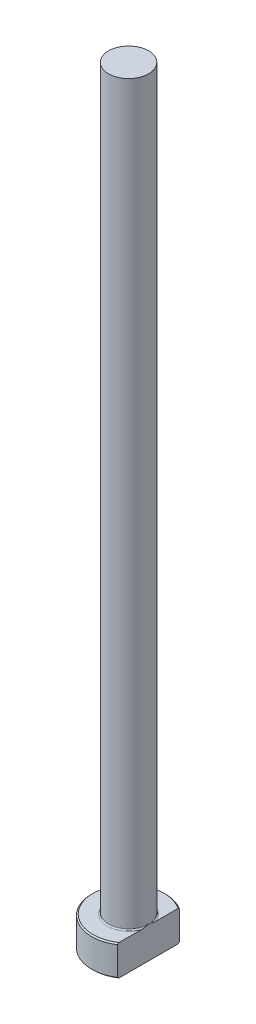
ISO-10303-21;
HEADER;
FILE_DESCRIPTION(('STEP AP214'),'2;1');
FILE_NAME('part.step','',(''),(''),'','','');
FILE_SCHEMA(('AUTOMOTIVE_DESIGN { 1 0 10303 214 1 1 1 1 }'));
ENDSEC;
DATA;
#1=APPLICATION_CONTEXT('core data for automotive mechanical design processes');
#2=APPLICATION_PROTOCOL_DEFINITION('international standard','automotive_design',2000,#1);
#3=PRODUCT_CONTEXT('',#1,'mechanical');
#4=PRODUCT('Part','Part','',(#3));
#5=PRODUCT_RELATED_PRODUCT_CATEGORY('part','',(#4));
#6=PRODUCT_DEFINITION_FORMATION('','',#4);
#7=PRODUCT_DEFINITION_CONTEXT('part definition',#1,'design');
#8=PRODUCT_DEFINITION('design','',#6,#7);
#9=PRODUCT_DEFINITION_SHAPE('','',#8);
#10=(LENGTH_UNIT() NAMED_UNIT(*) SI_UNIT(.MILLI.,.METRE.));
#11=(NAMED_UNIT(*) PLANE_ANGLE_UNIT() SI_UNIT($,.RADIAN.));
#12=(NAMED_UNIT(*) SI_UNIT($,.STERADIAN.) SOLID_ANGLE_UNIT());
#13=UNCERTAINTY_MEASURE_WITH_UNIT(LENGTH_MEASURE(1.E-05),#10,'distance_accuracy_value','');
#14=(GEOMETRIC_REPRESENTATION_CONTEXT(3) GLOBAL_UNCERTAINTY_ASSIGNED_CONTEXT((#13)) GLOBAL_UNIT_ASSIGNED_CONTEXT((#10,
#11,#12)) REPRESENTATION_CONTEXT('',''));
#15=CARTESIAN_POINT('',(0.,0.,0.));
#16=DIRECTION('',(0.,0.,1.));
#17=DIRECTION('',(1.,0.,0.));
#18=AXIS2_PLACEMENT_3D('',#15,#16,#17);
#19=CARTESIAN_POINT('',(0.,0.,0.));
#20=DIRECTION('',(0.,-1.,0.));
#21=DIRECTION('',(0.,0.,-1.));
#22=AXIS2_PLACEMENT_3D('',#19,#20,#21);
#23=PLANE('',#22);
#24=CARTESIAN_POINT('',(0.,0.,0.));
#25=DIRECTION('',(0.,-1.,0.));
#26=DIRECTION('',(0.,0.,-1.));
#27=AXIS2_PLACEMENT_3D('',#24,#25,#26);
#28=CIRCLE('',#27,5.79999999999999);
#29=CARTESIAN_POINT('',(3.24999999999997,0.,4.803904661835));
#30=VERTEX_POINT('',#29);
#31=CARTESIAN_POINT('',(3.24999999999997,0.,-4.803904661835));
#32=VERTEX_POINT('',#31);
#33=EDGE_CURVE('E98',#30,#32,#28,.T.);
#34=ORIENTED_EDGE('',*,*,#33,.T.);
#35=DIRECTION('',(0.,0.,1.));
#36=VECTOR('',#35,1.);
#37=CARTESIAN_POINT('',(3.24999999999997,0.,-5.04356025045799));
#38=LINE('',#37,#36);
#39=EDGE_CURVE('E83',#32,#30,#38,.T.);
#40=ORIENTED_EDGE('',*,*,#39,.T.);
#41=EDGE_LOOP('',(#34,#40));
#42=FACE_BOUND('',#41,.T.);
#43=ADVANCED_FACE('F32',(#42),#23,.T.);
#44=CARTESIAN_POINT('',(0.,259.958771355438,0.));
#45=DIRECTION('',(0.,1.,0.));
#46=DIRECTION('',(0.,0.,1.));
#47=AXIS2_PLACEMENT_3D('',#44,#45,#46);
#48=CYLINDRICAL_SURFACE('',#47,5.99999999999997);
#49=CARTESIAN_POINT('',(0.,4.79999999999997,0.));
#50=DIRECTION('',(0.,1.,0.));
#51=DIRECTION('',(0.,0.,1.));
#52=AXIS2_PLACEMENT_3D('',#49,#50,#51);
#53=CIRCLE('',#52,5.99999999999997);
#54=CARTESIAN_POINT('',(3.24999999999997,4.79999999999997,5.04356025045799));
#55=VERTEX_POINT('',#54);
#56=CARTESIAN_POINT('',(3.24999999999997,4.79999999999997,-5.04356025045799));
#57=VERTEX_POINT('',#56);
#58=EDGE_CURVE('E104',#55,#57,#53,.F.);
#59=ORIENTED_EDGE('',*,*,#58,.T.);
#60=DIRECTION('',(0.,-1.,0.));
#61=VECTOR('',#60,1.);
#62=CARTESIAN_POINT('',(3.24999999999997,125.,-5.04356025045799));
#63=LINE('',#62,#61);
#64=CARTESIAN_POINT('',(3.24999999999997,0.199999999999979,-5.04356025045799));
#65=VERTEX_POINT('',#64);
#66=EDGE_CURVE('E183',#57,#65,#63,.T.);
#67=ORIENTED_EDGE('',*,*,#66,.T.);
#68=CARTESIAN_POINT('',(0.,0.199999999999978,0.));
#69=DIRECTION('',(0.,-1.,0.));
#70=DIRECTION('',(0.,0.,-1.));
#71=AXIS2_PLACEMENT_3D('',#68,#69,#70);
#72=CIRCLE('',#71,5.99999999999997);
#73=CARTESIAN_POINT('',(3.24999999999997,0.199999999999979,5.04356025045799));
#74=VERTEX_POINT('',#73);
#75=EDGE_CURVE('E100',#65,#74,#72,.F.);
#76=ORIENTED_EDGE('',*,*,#75,.T.);
#77=DIRECTION('',(0.,-1.,0.));
#78=VECTOR('',#77,1.);
#79=CARTESIAN_POINT('',(3.24999999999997,125.,5.04356025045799));
#80=LINE('',#79,#78);
#81=EDGE_CURVE('E93',#55,#74,#80,.T.);
#82=ORIENTED_EDGE('',*,*,#81,.F.);
#83=EDGE_LOOP('',(#59,#67,#76,#82));
#84=FACE_BOUND('',#83,.T.);
#85=ADVANCED_FACE('F158',(#84),#48,.T.);
#86=CARTESIAN_POINT('',(-5.99999999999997,5.,0.));
#87=DIRECTION('',(0.,1.,0.));
#88=DIRECTION('',(0.,0.,1.));
#89=AXIS2_PLACEMENT_3D('',#86,#87,#88);
#90=PLANE('',#89);
#91=CARTESIAN_POINT('',(0.,5.,0.));
#92=DIRECTION('',(0.,1.,0.));
#93=DIRECTION('',(0.,0.,1.));
#94=AXIS2_PLACEMENT_3D('',#91,#92,#93);
#95=CIRCLE('',#94,5.79999999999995);
#96=CARTESIAN_POINT('',(3.24999999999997,5.,-4.80390466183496));
#97=VERTEX_POINT('',#96);
#98=CARTESIAN_POINT('',(3.24999999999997,5.,4.80390466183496));
#99=VERTEX_POINT('',#98);
#100=EDGE_CURVE('E178',#97,#99,#95,.T.);
#101=ORIENTED_EDGE('',*,*,#100,.T.);
#102=DIRECTION('',(0.,0.,-1.));
#103=VECTOR('',#102,1.);
#104=CARTESIAN_POINT('',(3.24999999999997,5.,0.));
#105=LINE('',#104,#103);
#106=CARTESIAN_POINT('',(3.24999999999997,4.99999999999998,1.15758369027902));
#107=VERTEX_POINT('',#106);
#108=EDGE_CURVE('E57',#99,#107,#105,.T.);
#109=ORIENTED_EDGE('',*,*,#108,.T.);
#110=CARTESIAN_POINT('',(0.,5.,0.));
#111=DIRECTION('',(0.,1.,0.));
#112=DIRECTION('',(0.,0.,1.));
#113=AXIS2_PLACEMENT_3D('',#110,#111,#112);
#114=CIRCLE('',#113,3.44999999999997);
#115=CARTESIAN_POINT('',(3.24999999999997,4.99999999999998,-1.15758369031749));
#116=VERTEX_POINT('',#115);
#117=EDGE_CURVE('E107',#107,#116,#114,.F.);
#118=ORIENTED_EDGE('',*,*,#117,.T.);
#119=EDGE_CURVE('E136',#116,#97,#105,.T.);
#120=ORIENTED_EDGE('',*,*,#119,.T.);
#121=EDGE_LOOP('',(#101,#109,#118,#120));
#122=FACE_BOUND('',#121,.T.);
#123=ADVANCED_FACE('F147',(#122),#90,.T.);
#124=CARTESIAN_POINT('',(0.,5.,0.));
#125=DIRECTION('',(0.,-1.,0.));
#126=DIRECTION('',(0.,0.,-1.));
#127=AXIS2_PLACEMENT_3D('',#124,#125,#126);
#128=CONICAL_SURFACE('',#127,5.79999999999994,0.785398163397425);
#129=ORIENTED_EDGE('',*,*,#58,.F.);
#130=CARTESIAN_POINT('',(3.24999999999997,-0.763340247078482,11.0972220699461));
#131=CARTESIAN_POINT('',(3.24999999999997,-0.555249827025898,10.8803821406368));
#132=CARTESIAN_POINT('',(3.24999999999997,-0.347401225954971,10.6633095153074));
#133=CARTESIAN_POINT('',(3.24999999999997,0.0676973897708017,10.2285893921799));
#134=CARTESIAN_POINT('',(3.24999999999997,0.274947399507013,10.0109418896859));
#135=CARTESIAN_POINT('',(3.24999999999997,0.688790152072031,9.57490319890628));
#136=CARTESIAN_POINT('',(3.24999999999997,0.895382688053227,9.35651181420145));
#137=CARTESIAN_POINT('',(3.24999999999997,1.30769007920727,8.91890298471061));
#138=CARTESIAN_POINT('',(3.24999999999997,1.51340493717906,8.69968554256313));
#139=CARTESIAN_POINT('',(3.24999999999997,1.92056067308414,8.26365159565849));
#140=CARTESIAN_POINT('',(3.24999999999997,2.12201828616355,8.04685072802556));
#141=CARTESIAN_POINT('',(3.24999999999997,2.52361432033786,7.61203089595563));
#142=CARTESIAN_POINT('',(3.24999999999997,2.72375274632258,7.39401193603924));
#143=CARTESIAN_POINT('',(3.24999999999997,3.12232031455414,6.95646589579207));
#144=CARTESIAN_POINT('',(3.24999999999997,3.3207496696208,6.73693900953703));
#145=CARTESIAN_POINT('',(3.24999999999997,3.71541049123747,6.29592064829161));
#146=CARTESIAN_POINT('',(3.24999999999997,3.91164199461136,6.07442920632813));
#147=CARTESIAN_POINT('',(3.24999999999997,4.26795525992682,5.6668464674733));
#148=CARTESIAN_POINT('',(3.24999999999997,4.42849662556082,5.48115751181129));
#149=CARTESIAN_POINT('',(3.24999999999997,4.74694681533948,5.10749706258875));
#150=CARTESIAN_POINT('',(3.24999999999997,4.90485537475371,4.91952534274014));
#151=CARTESIAN_POINT('',(3.24999999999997,5.21865243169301,4.53879767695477));
#152=CARTESIAN_POINT('',(3.24999999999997,5.37450606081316,4.34601291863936));
#153=CARTESIAN_POINT('',(3.24999999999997,5.68118935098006,3.95653844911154));
#154=CARTESIAN_POINT('',(3.24999999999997,5.83202036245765,3.75984981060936));
#155=CARTESIAN_POINT('',(3.24999999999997,6.05390638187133,3.45940852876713));
#156=CARTESIAN_POINT('',(3.24999999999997,6.12763821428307,3.35763377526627));
#157=CARTESIAN_POINT('',(3.24999999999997,6.27282302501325,3.1524747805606));
#158=CARTESIAN_POINT('',(3.24999999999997,6.34427612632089,3.04909062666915));
#159=CARTESIAN_POINT('',(3.24999999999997,6.48448981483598,2.84026816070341));
#160=CARTESIAN_POINT('',(3.24999999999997,6.55324599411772,2.73482687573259));
#161=CARTESIAN_POINT('',(3.24999999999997,6.68723865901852,2.52174014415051));
#162=CARTESIAN_POINT('',(3.24999999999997,6.75247550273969,2.41409492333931));
#163=CARTESIAN_POINT('',(3.24999999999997,6.87780644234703,2.19745654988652));
#164=CARTESIAN_POINT('',(3.24999999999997,6.93795082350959,2.08849289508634));
#165=CARTESIAN_POINT('',(3.24999999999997,7.05273719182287,1.86772106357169));
#166=CARTESIAN_POINT('',(3.24999999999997,7.10737807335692,1.75591232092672));
#167=CARTESIAN_POINT('',(3.24999999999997,7.26056715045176,1.41626442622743));
#168=CARTESIAN_POINT('',(3.24999999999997,7.34888232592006,1.18338115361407));
#169=CARTESIAN_POINT('',(3.24999999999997,7.44593218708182,0.835575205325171));
#170=CARTESIAN_POINT('',(3.24999999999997,7.47182229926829,0.725406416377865));
#171=CARTESIAN_POINT('',(3.24999999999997,7.51310579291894,0.503078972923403));
#172=CARTESIAN_POINT('',(3.24999999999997,7.52850034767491,0.390920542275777));
#173=CARTESIAN_POINT('',(3.24999999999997,7.54767882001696,0.166070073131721));
#174=CARTESIAN_POINT('',(3.24999999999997,7.5515109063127,0.0533822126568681));
#175=CARTESIAN_POINT('',(3.24999999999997,7.54741082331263,-0.171782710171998));
#176=CARTESIAN_POINT('',(3.24999999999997,7.53947794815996,-0.28425975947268));
#177=CARTESIAN_POINT('',(3.24999999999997,7.5125352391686,-0.50702510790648));
#178=CARTESIAN_POINT('',(3.24999999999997,7.4936058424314,-0.617323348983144));
#179=CARTESIAN_POINT('',(3.24999999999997,7.44595440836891,-0.835762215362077));
#180=CARTESIAN_POINT('',(3.24999999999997,7.41723093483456,-0.94390252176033));
#181=CARTESIAN_POINT('',(3.24999999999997,7.35127840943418,-1.15830231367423));
#182=CARTESIAN_POINT('',(3.24999999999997,7.31399439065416,-1.2645446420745));
#183=CARTESIAN_POINT('',(3.24999999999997,7.23254630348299,-1.4743033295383));
#184=CARTESIAN_POINT('',(3.24999999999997,7.18838353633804,-1.57782019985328));
#185=CARTESIAN_POINT('',(3.24999999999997,7.09672451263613,-1.77742382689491));
#186=CARTESIAN_POINT('',(3.24999999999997,7.04948595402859,-1.87363004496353));
#187=CARTESIAN_POINT('',(3.24999999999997,6.95089019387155,-2.0639177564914));
#188=CARTESIAN_POINT('',(3.24999999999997,6.8995321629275,-2.15799881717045));
#189=CARTESIAN_POINT('',(3.24999999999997,6.74036914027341,-2.43755985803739));
#190=CARTESIAN_POINT('',(3.24999999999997,6.62755752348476,-2.62018561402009));
#191=CARTESIAN_POINT('',(3.24999999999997,6.39256809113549,-2.98019331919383));
#192=CARTESIAN_POINT('',(3.24999999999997,6.27035601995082,-3.15755247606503));
#193=CARTESIAN_POINT('',(3.24999999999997,6.01970117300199,-3.50765833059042));
#194=CARTESIAN_POINT('',(3.24999999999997,5.89126140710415,-3.68040719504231));
#195=CARTESIAN_POINT('',(3.24999999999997,5.62829316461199,-4.02448614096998));
#196=CARTESIAN_POINT('',(3.24999999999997,5.4937100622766,-4.19577421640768));
#197=CARTESIAN_POINT('',(3.24999999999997,5.22110967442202,-4.53561452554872));
#198=CARTESIAN_POINT('',(3.24999999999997,5.08309204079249,-4.70416647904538));
#199=CARTESIAN_POINT('',(3.24999999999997,4.80478673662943,-5.03871726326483));
#200=CARTESIAN_POINT('',(3.24999999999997,4.66450509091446,-5.20472111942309));
#201=CARTESIAN_POINT('',(3.24999999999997,4.38193422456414,-5.53501285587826));
#202=CARTESIAN_POINT('',(3.24999999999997,4.23964496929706,-5.6993007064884));
#203=CARTESIAN_POINT('',(3.24999999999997,3.89726045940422,-6.09077577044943));
#204=CARTESIAN_POINT('',(3.24999999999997,3.69642117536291,-6.31731165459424));
#205=CARTESIAN_POINT('',(3.24999999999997,3.29246897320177,-6.76834962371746));
#206=CARTESIAN_POINT('',(3.24999999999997,3.08935601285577,-6.99285167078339));
#207=CARTESIAN_POINT('',(3.24999999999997,2.68122553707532,-7.44046009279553));
#208=CARTESIAN_POINT('',(3.24999999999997,2.4762065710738,-7.66356514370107));
#209=CARTESIAN_POINT('',(3.24999999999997,2.06481442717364,-8.10852300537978));
#210=CARTESIAN_POINT('',(3.24999999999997,1.85844124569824,-8.33037581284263));
#211=CARTESIAN_POINT('',(3.24999999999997,1.45176082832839,-8.76543407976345));
#212=CARTESIAN_POINT('',(3.24999999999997,1.25149010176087,-8.97867369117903));
#213=CARTESIAN_POINT('',(3.24999999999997,0.850131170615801,-9.40438299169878));
#214=CARTESIAN_POINT('',(3.24999999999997,0.649042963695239,-9.61685267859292));
#215=CARTESIAN_POINT('',(3.24999999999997,0.246391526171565,-10.0409455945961));
#216=CARTESIAN_POINT('',(3.24999999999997,0.0448289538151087,-10.252569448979));
#217=CARTESIAN_POINT('',(3.24999999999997,-0.358859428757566,-10.6752763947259));
#218=CARTESIAN_POINT('',(3.24999999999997,-0.560985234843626,-10.8863594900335));
#219=CARTESIAN_POINT('',(3.24999999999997,-0.763340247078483,-11.0972220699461));
#220=B_SPLINE_CURVE_WITH_KNOTS('',3,(#130,#131,#132,#133,#134,#135,#136,#137,#138,#139,#140,
#141,#142,#143,#144,#145,#146,#147,#148,#149,#150,#151,#152,#153,#154,#155,#156,#157,#158,#159,
#160,#161,#162,#163,#164,#165,#166,#167,#168,#169,#170,#171,#172,#173,#174,#175,#176,#177,#178,
#179,#180,#181,#182,#183,#184,#185,#186,#187,#188,#189,#190,#191,#192,#193,#194,#195,#196,#197,
#198,#199,#200,#201,#202,#203,#204,#205,#206,#207,#208,#209,#210,#211,#212,#213,#214,#215,#216,
#217,#218,#219),.UNSPECIFIED.,.F.,.F.,(4,2,2,2,2,2,2,2,2,2,2,2,2,2,2,2,2,2,2,2,2,2,2,2,2,2,2,2,
2,2,2,2,2,2,2,2,2,2,2,2,2,2,2,2,4),(0.,0.901604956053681,1.80321729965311,2.70508973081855,
3.60695928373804,4.49481204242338,5.38266150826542,6.27039876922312,7.15812113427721,
7.89450333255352,8.63095913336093,9.37461869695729,10.1180766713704,10.4950808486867,
10.8720646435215,11.2496408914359,11.6271786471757,12.0003984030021,12.3736929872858,
13.1174054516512,13.45650589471,13.7955684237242,14.1332164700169,14.4708847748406,
14.8061136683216,15.141391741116,15.478886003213,15.8163164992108,16.1377318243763,
16.4592120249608,17.1027431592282,17.7487418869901,18.3944314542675,19.0478814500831,
19.7013979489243,20.353394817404,21.0054029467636,21.9136176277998,22.821849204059,
23.7308402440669,24.6398336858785,25.5174503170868,26.3950694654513,27.2718289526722,
28.1485820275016),.UNSPECIFIED.);
#221=EDGE_CURVE('E135',#55,#99,#220,.T.);
#222=ORIENTED_EDGE('',*,*,#221,.T.);
#223=ORIENTED_EDGE('',*,*,#100,.F.);
#224=EDGE_CURVE('E127',#97,#57,#220,.T.);
#225=ORIENTED_EDGE('',*,*,#224,.T.);
#226=EDGE_LOOP('',(#129,#222,#223,#225));
#227=FACE_BOUND('',#226,.T.);
#228=ADVANCED_FACE('F143',(#227),#128,.T.);
#229=CARTESIAN_POINT('',(0.,0.199999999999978,0.));
#230=DIRECTION('',(0.,1.,0.));
#231=DIRECTION('',(0.,0.,1.));
#232=AXIS2_PLACEMENT_3D('',#229,#230,#231);
#233=CONICAL_SURFACE('',#232,5.99999999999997,0.785398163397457);
#234=ORIENTED_EDGE('',*,*,#75,.F.);
#235=CARTESIAN_POINT('',(3.24999999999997,5.76334024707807,-11.097222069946));
#236=CARTESIAN_POINT('',(3.24999999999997,5.5552498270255,-10.8803821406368));
#237=CARTESIAN_POINT('',(3.24999999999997,5.34740122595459,-10.6633095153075));
#238=CARTESIAN_POINT('',(3.24999999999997,4.93230261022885,-10.2285893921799));
#239=CARTESIAN_POINT('',(3.24999999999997,4.72505260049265,-10.0109418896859));
#240=CARTESIAN_POINT('',(3.24999999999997,4.31120984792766,-9.57490319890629));
#241=CARTESIAN_POINT('',(3.24999999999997,4.10461731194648,-9.35651181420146));
#242=CARTESIAN_POINT('',(3.24999999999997,3.69230992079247,-8.91890298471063));
#243=CARTESIAN_POINT('',(3.24999999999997,3.4865950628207,-8.69968554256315));
#244=CARTESIAN_POINT('',(3.24999999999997,3.07943932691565,-8.26365159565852));
#245=CARTESIAN_POINT('',(3.24999999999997,2.87798171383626,-8.0468507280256));
#246=CARTESIAN_POINT('',(3.24999999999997,2.47638567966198,-7.61203089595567));
#247=CARTESIAN_POINT('',(3.24999999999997,2.27624725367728,-7.3940119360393));
#248=CARTESIAN_POINT('',(3.24999999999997,1.87767968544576,-6.95646589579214));
#249=CARTESIAN_POINT('',(3.24999999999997,1.67925033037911,-6.7369390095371));
#250=CARTESIAN_POINT('',(3.24999999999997,1.28458950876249,-6.2959206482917));
#251=CARTESIAN_POINT('',(3.24999999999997,1.08835800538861,-6.07442920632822));
#252=CARTESIAN_POINT('',(3.24999999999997,0.732044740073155,-5.66684646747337));
#253=CARTESIAN_POINT('',(3.24999999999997,0.571503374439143,-5.48115751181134));
#254=CARTESIAN_POINT('',(3.24999999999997,0.253053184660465,-5.10749706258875));
#255=CARTESIAN_POINT('',(3.24999999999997,0.0951446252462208,-4.91952534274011));
#256=CARTESIAN_POINT('',(3.24999999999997,-0.218652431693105,-4.53879767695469));
#257=CARTESIAN_POINT('',(3.24999999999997,-0.374506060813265,-4.34601291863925));
#258=CARTESIAN_POINT('',(3.24999999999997,-0.681189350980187,-3.95653844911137));
#259=CARTESIAN_POINT('',(3.24999999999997,-0.832020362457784,-3.75984981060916));
#260=CARTESIAN_POINT('',(3.24999999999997,-1.05390638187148,-3.45940852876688));
#261=CARTESIAN_POINT('',(3.24999999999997,-1.12763821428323,-3.35763377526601));
#262=CARTESIAN_POINT('',(3.24999999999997,-1.27282302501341,-3.1524747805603));
#263=CARTESIAN_POINT('',(3.24999999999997,-1.34427612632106,-3.04909062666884));
#264=CARTESIAN_POINT('',(3.24999999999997,-1.48448981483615,-2.84026816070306));
#265=CARTESIAN_POINT('',(3.24999999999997,-1.55324599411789,-2.73482687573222));
#266=CARTESIAN_POINT('',(3.24999999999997,-1.68723865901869,-2.52174014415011));
#267=CARTESIAN_POINT('',(3.24999999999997,-1.75247550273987,-2.41409492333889));
#268=CARTESIAN_POINT('',(3.24999999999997,-1.8778064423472,-2.19745654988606));
#269=CARTESIAN_POINT('',(3.24999999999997,-1.93795082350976,-2.08849289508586));
#270=CARTESIAN_POINT('',(3.24999999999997,-2.05273719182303,-1.86772106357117));
#271=CARTESIAN_POINT('',(3.24999999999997,-2.10737807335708,-1.75591232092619));
#272=CARTESIAN_POINT('',(3.24999999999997,-2.26056715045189,-1.41626442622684));
#273=CARTESIAN_POINT('',(3.24999999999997,-2.34888232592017,-1.18338115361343));
#274=CARTESIAN_POINT('',(3.24999999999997,-2.44593218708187,-0.83557520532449));
#275=CARTESIAN_POINT('',(3.24999999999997,-2.47182229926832,-0.725406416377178));
#276=CARTESIAN_POINT('',(3.24999999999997,-2.51310579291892,-0.503078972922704));
#277=CARTESIAN_POINT('',(3.24999999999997,-2.52850034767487,-0.390920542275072));
#278=CARTESIAN_POINT('',(3.24999999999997,-2.54767882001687,-0.166070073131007));
#279=CARTESIAN_POINT('',(3.24999999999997,-2.55151090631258,-0.0533822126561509));
#280=CARTESIAN_POINT('',(3.24999999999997,-2.54741082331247,0.171782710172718));
#281=CARTESIAN_POINT('',(3.24999999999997,-2.53947794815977,0.284259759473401));
#282=CARTESIAN_POINT('',(3.24999999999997,-2.51253523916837,0.507025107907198));
#283=CARTESIAN_POINT('',(3.24999999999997,-2.49360584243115,0.617323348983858));
#284=CARTESIAN_POINT('',(3.24999999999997,-2.44595440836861,0.835762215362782));
#285=CARTESIAN_POINT('',(3.24999999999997,-2.41723093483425,0.94390252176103));
#286=CARTESIAN_POINT('',(3.24999999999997,-2.35127840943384,1.15830231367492));
#287=CARTESIAN_POINT('',(3.24999999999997,-2.3139943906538,1.26454464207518));
#288=CARTESIAN_POINT('',(3.24999999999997,-2.23254630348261,1.47430332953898));
#289=CARTESIAN_POINT('',(3.24999999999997,-2.18838353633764,1.57782019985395));
#290=CARTESIAN_POINT('',(3.24999999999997,-2.09672451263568,1.77742382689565));
#291=CARTESIAN_POINT('',(3.24999999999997,-2.04948595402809,1.87363004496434));
#292=CARTESIAN_POINT('',(3.24999999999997,-1.95089019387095,2.06391775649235));
#293=CARTESIAN_POINT('',(3.24999999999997,-1.89953216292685,2.15799881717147));
#294=CARTESIAN_POINT('',(3.24999999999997,-1.7403691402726,2.43755985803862));
#295=CARTESIAN_POINT('',(3.24999999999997,-1.62755752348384,2.62018561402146));
#296=CARTESIAN_POINT('',(3.24999999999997,-1.39256809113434,2.98019331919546));
#297=CARTESIAN_POINT('',(3.24999999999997,-1.27035601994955,3.15755247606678));
#298=CARTESIAN_POINT('',(3.24999999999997,-1.01970117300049,3.50765833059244));
#299=CARTESIAN_POINT('',(3.24999999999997,-0.89126140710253,3.68040719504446));
#300=CARTESIAN_POINT('',(3.24999999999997,-0.628293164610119,4.02448614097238));
#301=CARTESIAN_POINT('',(3.24999999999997,-0.493710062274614,4.19577421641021));
#302=CARTESIAN_POINT('',(3.24999999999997,-0.221109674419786,4.5356145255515));
#303=CARTESIAN_POINT('',(3.24999999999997,-0.0830920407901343,4.70416647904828));
#304=CARTESIAN_POINT('',(3.24999999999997,0.19521326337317,5.03871726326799));
#305=CARTESIAN_POINT('',(3.24999999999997,0.335494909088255,5.20472111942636));
#306=CARTESIAN_POINT('',(3.24999999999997,0.61806577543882,5.53501285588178));
#307=CARTESIAN_POINT('',(3.24999999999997,0.760355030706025,5.69930070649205));
#308=CARTESIAN_POINT('',(3.24999999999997,1.10273954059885,6.09077577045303));
#309=CARTESIAN_POINT('',(3.24999999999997,1.30357882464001,6.31731165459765));
#310=CARTESIAN_POINT('',(3.24999999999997,1.70753102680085,6.76834962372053));
#311=CARTESIAN_POINT('',(3.24999999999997,1.91064398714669,6.99285167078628));
#312=CARTESIAN_POINT('',(3.24999999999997,2.31877446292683,7.44046009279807));
#313=CARTESIAN_POINT('',(3.24999999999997,2.52379342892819,7.66356514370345));
#314=CARTESIAN_POINT('',(3.24999999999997,2.93518557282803,8.10852300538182));
#315=CARTESIAN_POINT('',(3.24999999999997,3.14155875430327,8.33037581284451));
#316=CARTESIAN_POINT('',(3.24999999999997,3.54823917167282,8.76543407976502));
#317=CARTESIAN_POINT('',(3.24999999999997,3.74850989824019,8.97867369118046));
#318=CARTESIAN_POINT('',(3.24999999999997,4.14986882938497,9.40438299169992));
#319=CARTESIAN_POINT('',(3.24999999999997,4.35095703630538,9.61685267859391));
#320=CARTESIAN_POINT('',(3.24999999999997,4.75360847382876,10.0409455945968));
#321=CARTESIAN_POINT('',(3.24999999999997,4.95517104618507,10.2525694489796));
#322=CARTESIAN_POINT('',(3.24999999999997,5.35885942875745,10.6752763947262));
#323=CARTESIAN_POINT('',(3.24999999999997,5.56098523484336,10.8863594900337));
#324=CARTESIAN_POINT('',(3.24999999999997,5.76334024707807,11.097222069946));
#325=B_SPLINE_CURVE_WITH_KNOTS('',3,(#235,#236,#237,#238,#239,#240,#241,#242,#243,#244,#245,
#246,#247,#248,#249,#250,#251,#252,#253,#254,#255,#256,#257,#258,#259,#260,#261,#262,#263,#264,
#265,#266,#267,#268,#269,#270,#271,#272,#273,#274,#275,#276,#277,#278,#279,#280,#281,#282,#283,
#284,#285,#286,#287,#288,#289,#290,#291,#292,#293,#294,#295,#296,#297,#298,#299,#300,#301,#302,
#303,#304,#305,#306,#307,#308,#309,#310,#311,#312,#313,#314,#315,#316,#317,#318,#319,#320,#321,
#322,#323,#324),.UNSPECIFIED.,.F.,.F.,(4,2,2,2,2,2,2,2,2,2,2,2,2,2,2,2,2,2,2,2,2,2,2,2,2,2,2,2,
2,2,2,2,2,2,2,2,2,2,2,2,2,2,2,2,4),(0.,0.901604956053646,1.80321729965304,2.70508973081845,
3.6069592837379,4.49481204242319,5.38266150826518,6.27039876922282,7.15812113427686,
7.89450333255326,8.63095913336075,9.37461869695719,10.1180766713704,10.4950808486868,
10.8720646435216,11.249640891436,11.6271786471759,12.0003984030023,12.3736929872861,
13.1174054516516,13.4565058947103,13.7955684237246,14.1332164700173,14.470884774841,
14.806113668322,15.1413917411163,15.4788860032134,15.8163164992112,16.1377318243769,
16.4592120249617,17.1027431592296,17.7487418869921,18.39443145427,19.0478814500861,
19.7013979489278,20.353394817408,21.0054029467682,21.9136176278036,22.8218492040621,
23.7308402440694,24.6398336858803,25.517450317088,26.3950694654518,27.2718289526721,
28.1485820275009),.UNSPECIFIED.);
#326=EDGE_CURVE('E86',#65,#32,#325,.T.);
#327=ORIENTED_EDGE('',*,*,#326,.T.);
#328=ORIENTED_EDGE('',*,*,#33,.F.);
#329=EDGE_CURVE('E89',#30,#74,#325,.T.);
#330=ORIENTED_EDGE('',*,*,#329,.T.);
#331=EDGE_LOOP('',(#234,#327,#328,#330));
#332=FACE_BOUND('',#331,.T.);
#333=ADVANCED_FACE('F97',(#332),#233,.T.);
#334=CARTESIAN_POINT('',(0.,5.19999999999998,0.));
#335=DIRECTION('',(0.,1.,0.));
#336=DIRECTION('',(0.,0.,1.));
#337=AXIS2_PLACEMENT_3D('',#334,#335,#336);
#338=TOROIDAL_SURFACE('',#337,3.44999999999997,0.2);
#339=CARTESIAN_POINT('',(3.24999999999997,5.19999999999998,0.));
#340=CARTESIAN_POINT('',(3.24999999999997,5.20000050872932,1.30593484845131E-10));
#341=CARTESIAN_POINT('',(3.24999999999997,5.20000101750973,-2.02989018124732E-07));
#342=CARTESIAN_POINT('',(3.24999999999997,5.20000196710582,-7.62846146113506E-07));
#343=CARTESIAN_POINT('',(3.24999999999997,5.20000239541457,-1.13332165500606E-06));
#344=CARTESIAN_POINT('',(3.24999999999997,5.20000328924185,-2.02149564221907E-06));
#345=CARTESIAN_POINT('',(3.24999999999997,5.20000374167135,-2.55359112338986E-06));
#346=CARTESIAN_POINT('',(3.24999999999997,5.20000454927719,-3.65434903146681E-06));
#347=CARTESIAN_POINT('',(3.24999999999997,5.20000490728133,-4.22110424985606E-06));
#348=CARTESIAN_POINT('',(3.24999999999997,5.20000624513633,-6.42540895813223E-06));
#349=CARTESIAN_POINT('',(3.24999999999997,5.20000715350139,-8.1091236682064E-06));
#350=CARTESIAN_POINT('',(3.24999999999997,5.20000863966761,-1.14364149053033E-05));
#351=CARTESIAN_POINT('',(3.24999999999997,5.20000923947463,-1.30705587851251E-05));
#352=CARTESIAN_POINT('',(3.24999999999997,5.20001177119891,-2.00139280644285E-05));
#353=CARTESIAN_POINT('',(3.24999999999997,5.20001367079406,-2.53379428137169E-05));
#354=CARTESIAN_POINT('',(3.24999999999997,5.20001645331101,-3.53765138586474E-05));
#355=CARTESIAN_POINT('',(3.24999999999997,5.20001744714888,-4.00600779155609E-05));
#356=CARTESIAN_POINT('',(3.24999999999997,5.20002471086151,-7.49504389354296E-05));
#357=CARTESIAN_POINT('',(3.24999999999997,5.20003024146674,-0.00010526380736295));
#358=CARTESIAN_POINT('',(3.24999999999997,5.20005445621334,-0.00022532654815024));
#359=CARTESIAN_POINT('',(3.24999999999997,5.20007753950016,-0.000314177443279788));
#360=CARTESIAN_POINT('',(3.24999999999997,5.20016768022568,-0.000666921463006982));
#361=CARTESIAN_POINT('',(3.24999999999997,5.20023191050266,-0.000931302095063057));
#362=CARTESIAN_POINT('',(3.24999999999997,5.20048969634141,-0.00198463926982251));
#363=CARTESIAN_POINT('',(3.24999999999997,5.20068683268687,-0.0027729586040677));
#364=CARTESIAN_POINT('',(3.24999999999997,5.20150726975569,-0.00606245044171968));
#365=CARTESIAN_POINT('',(3.24999999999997,5.20212605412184,-0.00856442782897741));
#366=CARTESIAN_POINT('',(3.24999999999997,5.20719838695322,-0.0290628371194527));
#367=CARTESIAN_POINT('',(3.24999999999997,5.21166800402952,-0.0470565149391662));
#368=CARTESIAN_POINT('',(3.24999999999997,5.22040162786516,-0.0823313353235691));
#369=CARTESIAN_POINT('',(3.24999999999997,5.22466671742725,-0.0996122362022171));
#370=CARTESIAN_POINT('',(3.24999999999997,5.23855308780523,-0.156076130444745));
#371=CARTESIAN_POINT('',(3.24999999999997,5.24811538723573,-0.195273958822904));
#372=CARTESIAN_POINT('',(3.24999999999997,5.26421029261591,-0.262424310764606));
#373=CARTESIAN_POINT('',(3.24999999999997,5.27082096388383,-0.290358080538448));
#374=CARTESIAN_POINT('',(3.24999999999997,5.28365202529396,-0.345539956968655));
#375=CARTESIAN_POINT('',(3.24999999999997,5.28987810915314,-0.3727867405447));
#376=CARTESIAN_POINT('',(3.24999999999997,5.30721519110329,-0.45039737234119));
#377=CARTESIAN_POINT('',(3.24999999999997,5.31800675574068,-0.500833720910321));
#378=CARTESIAN_POINT('',(3.24999999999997,5.33836987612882,-0.60242326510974));
#379=CARTESIAN_POINT('',(3.24999999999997,5.34792968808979,-0.653578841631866));
#380=CARTESIAN_POINT('',(3.24999999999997,5.36597954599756,-0.760718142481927));
#381=CARTESIAN_POINT('',(3.24999999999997,5.37430170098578,-0.81673101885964));
#382=CARTESIAN_POINT('',(3.24999999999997,5.38793579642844,-0.928977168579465));
#383=CARTESIAN_POINT('',(3.24999999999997,5.39325594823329,-0.985209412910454));
#384=CARTESIAN_POINT('',(3.24999999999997,5.39967715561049,-1.09627192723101));
#385=CARTESIAN_POINT('',(3.24999999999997,5.40090002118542,-1.15109363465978));
#386=CARTESIAN_POINT('',(3.24999999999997,5.39854105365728,-1.23278196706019));
#387=CARTESIAN_POINT('',(3.24999999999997,5.397083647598,-1.25970835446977));
#388=CARTESIAN_POINT('',(3.24999999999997,5.39248016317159,-1.31340846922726));
#389=CARTESIAN_POINT('',(3.24999999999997,5.38933527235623,-1.34018229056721));
#390=CARTESIAN_POINT('',(3.24999999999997,5.38085808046,-1.39365539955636));
#391=CARTESIAN_POINT('',(3.24999999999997,5.37550486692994,-1.42035144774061));
#392=CARTESIAN_POINT('',(3.24999999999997,5.36186683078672,-1.47304562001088));
#393=CARTESIAN_POINT('',(3.24999999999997,5.35358306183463,-1.49904399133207));
#394=CARTESIAN_POINT('',(3.24999999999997,5.33840624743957,-1.53566403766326));
#395=CARTESIAN_POINT('',(3.24999999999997,5.33319528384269,-1.54697847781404));
#396=CARTESIAN_POINT('',(3.24999999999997,5.32165705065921,-1.56904809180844));
#397=CARTESIAN_POINT('',(3.24999999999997,5.31532920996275,-1.57980297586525));
#398=CARTESIAN_POINT('',(3.24999999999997,5.30232638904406,-1.5988624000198));
#399=CARTESIAN_POINT('',(3.24999999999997,5.2958406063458,-1.60729427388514));
#400=CARTESIAN_POINT('',(3.24999999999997,5.28165581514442,-1.62307272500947));
#401=CARTESIAN_POINT('',(3.24999999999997,5.2739607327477,-1.63042267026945));
#402=CARTESIAN_POINT('',(3.24999999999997,5.26066720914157,-1.64067803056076));
#403=CARTESIAN_POINT('',(3.24999999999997,5.25551950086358,-1.64416379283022));
#404=CARTESIAN_POINT('',(3.24999999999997,5.24475577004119,-1.65032852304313));
#405=CARTESIAN_POINT('',(3.24999999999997,5.23914006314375,-1.65300802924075));
#406=CARTESIAN_POINT('',(3.24999999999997,5.22744494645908,-1.65736207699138));
#407=CARTESIAN_POINT('',(3.24999999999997,5.22136079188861,-1.65902420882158));
#408=CARTESIAN_POINT('',(3.24999999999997,5.20898349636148,-1.66109219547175));
#409=CARTESIAN_POINT('',(3.24999999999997,5.20269065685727,-1.66149978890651));
#410=CARTESIAN_POINT('',(3.24999999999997,5.19107570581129,-1.66104520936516));
#411=CARTESIAN_POINT('',(3.24999999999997,5.18574582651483,-1.66035949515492));
#412=CARTESIAN_POINT('',(3.24999999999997,5.17527668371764,-1.65810570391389));
#413=CARTESIAN_POINT('',(3.24999999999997,5.1701375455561,-1.65653705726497));
#414=CARTESIAN_POINT('',(3.24999999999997,5.15872192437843,-1.65208432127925));
#415=CARTESIAN_POINT('',(3.24999999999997,5.15254320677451,-1.64895170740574));
#416=CARTESIAN_POINT('',(3.24999999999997,5.14076776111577,-1.64173915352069));
#417=CARTESIAN_POINT('',(3.24999999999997,5.13517231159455,-1.63765719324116));
#418=CARTESIAN_POINT('',(3.24999999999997,5.12145239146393,-1.62621801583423));
#419=CARTESIAN_POINT('',(3.24999999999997,5.11376432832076,-1.61834208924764));
#420=CARTESIAN_POINT('',(3.24999999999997,5.09963913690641,-1.6015591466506));
#421=CARTESIAN_POINT('',(3.24999999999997,5.0932043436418,-1.59265025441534));
#422=CARTESIAN_POINT('',(3.24999999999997,5.07579513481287,-1.56554611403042));
#423=CARTESIAN_POINT('',(3.24999999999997,5.06621235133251,-1.54646705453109));
#424=CARTESIAN_POINT('',(3.24999999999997,5.04964498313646,-1.5071324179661));
#425=CARTESIAN_POINT('',(3.24999999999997,5.04268052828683,-1.48686905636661));
#426=CARTESIAN_POINT('',(3.24999999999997,5.02812767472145,-1.43684519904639));
#427=CARTESIAN_POINT('',(3.24999999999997,5.02158372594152,-1.40678481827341));
#428=CARTESIAN_POINT('',(3.24999999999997,5.01134780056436,-1.3461374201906));
#429=CARTESIAN_POINT('',(3.24999999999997,5.00766434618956,-1.31554910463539));
#430=CARTESIAN_POINT('',(3.24999999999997,5.00256038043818,-1.2550900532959));
#431=CARTESIAN_POINT('',(3.24999999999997,5.00107707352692,-1.22522437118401));
#432=CARTESIAN_POINT('',(3.24999999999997,4.99975288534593,-1.16560651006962));
#433=CARTESIAN_POINT('',(3.24999999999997,4.99990422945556,-1.13585446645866));
#434=CARTESIAN_POINT('',(3.24999999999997,5.00180470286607,-1.06636643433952));
#435=CARTESIAN_POINT('',(3.24999999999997,5.00407520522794,-1.02664548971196));
#436=CARTESIAN_POINT('',(3.24999999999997,5.01046283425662,-0.947373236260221));
#437=CARTESIAN_POINT('',(3.24999999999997,5.01457941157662,-0.907821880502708));
#438=CARTESIAN_POINT('',(3.24999999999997,5.02439538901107,-0.827971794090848));
#439=CARTESIAN_POINT('',(3.24999999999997,5.03012984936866,-0.787677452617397));
#440=CARTESIAN_POINT('',(3.24999999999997,5.0428354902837,-0.707180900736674));
#441=CARTESIAN_POINT('',(3.24999999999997,5.04980982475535,-0.666979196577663));
#442=CARTESIAN_POINT('',(3.24999999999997,5.06745383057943,-0.572058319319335));
#443=CARTESIAN_POINT('',(3.24999999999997,5.07854113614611,-0.517417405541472));
#444=CARTESIAN_POINT('',(3.24999999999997,5.10182947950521,-0.409021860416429));
#445=CARTESIAN_POINT('',(3.24999999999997,5.11401657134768,-0.355264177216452));
#446=CARTESIAN_POINT('',(3.24999999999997,5.13769793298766,-0.254099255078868));
#447=CARTESIAN_POINT('',(3.24999999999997,5.14911069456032,-0.206672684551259));
#448=CARTESIAN_POINT('',(3.24999999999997,5.1727713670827,-0.109852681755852));
#449=CARTESIAN_POINT('',(3.24999999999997,5.18503405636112,-0.0604628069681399));
#450=CARTESIAN_POINT('',(3.24999999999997,5.19787537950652,-0.0085581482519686));
#451=CARTESIAN_POINT('',(3.24999999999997,5.19849580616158,-0.00604992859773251));
#452=CARTESIAN_POINT('',(3.24999999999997,5.19931662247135,-0.00275902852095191));
#453=CARTESIAN_POINT('',(3.24999999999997,5.19951254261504,-0.00197555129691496));
#454=CARTESIAN_POINT('',(3.24999999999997,5.1997688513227,-0.000928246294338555));
#455=CARTESIAN_POINT('',(3.24999999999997,5.19983279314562,-0.000665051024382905));
#456=CARTESIAN_POINT('',(3.24999999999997,5.19992258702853,-0.000313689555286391));
#457=CARTESIAN_POINT('',(3.24999999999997,5.19994562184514,-0.000225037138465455));
#458=CARTESIAN_POINT('',(3.24999999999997,5.19996979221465,-0.000105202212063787));
#459=CARTESIAN_POINT('',(3.24999999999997,5.19997531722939,-7.49162835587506E-05));
#460=CARTESIAN_POINT('',(3.24999999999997,5.19998256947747,-4.0053976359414E-05));
#461=CARTESIAN_POINT('',(3.24999999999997,5.1999835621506,-3.53718998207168E-05));
#462=CARTESIAN_POINT('',(3.24999999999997,5.19998634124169,-2.53364128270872E-05));
#463=CARTESIAN_POINT('',(3.24999999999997,5.19998823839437,-2.00139156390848E-05));
#464=CARTESIAN_POINT('',(3.24999999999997,5.19999076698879,-1.30721306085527E-05));
#465=CARTESIAN_POINT('',(3.24999999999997,5.19999136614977,-1.14380977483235E-05));
#466=CARTESIAN_POINT('',(3.24999999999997,5.19999285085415,-8.11092555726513E-06));
#467=CARTESIAN_POINT('',(3.24999999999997,5.19999375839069,-6.42720440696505E-06));
#468=CARTESIAN_POINT('',(3.24999999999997,5.19999509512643,-4.2227718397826E-06));
#469=CARTESIAN_POINT('',(3.24999999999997,5.1999954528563,-3.65594799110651E-06));
#470=CARTESIAN_POINT('',(3.24999999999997,5.19999625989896,-2.55500330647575E-06));
#471=CARTESIAN_POINT('',(3.24999999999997,5.19999671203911,-2.0227876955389E-06));
#472=CARTESIAN_POINT('',(3.24999999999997,5.19999760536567,-1.13433308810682E-06));
#473=CARTESIAN_POINT('',(3.24999999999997,5.19999803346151,-7.63708107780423E-07));
#474=CARTESIAN_POINT('',(3.24999999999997,5.19999898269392,-2.03470796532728E-07));
#475=CARTESIAN_POINT('',(3.24999999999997,5.19999949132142,-1.30580450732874E-10));
#476=CARTESIAN_POINT('',(3.24999999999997,5.19999999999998,0.));
#477=B_SPLINE_CURVE_WITH_KNOTS('',3,(#339,#340,#341,#342,#343,#344,#345,#346,#347,#348,#349,
#350,#351,#352,#353,#354,#355,#356,#357,#358,#359,#360,#361,#362,#363,#364,#365,#366,#367,#368,
#369,#370,#371,#372,#373,#374,#375,#376,#377,#378,#379,#380,#381,#382,#383,#384,#385,#386,#387,
#388,#389,#390,#391,#392,#393,#394,#395,#396,#397,#398,#399,#400,#401,#402,#403,#404,#405,#406,
#407,#408,#409,#410,#411,#412,#413,#414,#415,#416,#417,#418,#419,#420,#421,#422,#423,#424,#425,
#426,#427,#428,#429,#430,#431,#432,#433,#434,#435,#436,#437,#438,#439,#440,#441,#442,#443,#444,
#445,#446,#447,#448,#449,#450,#451,#452,#453,#454,#455,#456,#457,#458,#459,#460,#461,#462,#463,
#464,#465,#466,#467,#468,#469,#470,#471,#472,#473,#474,#475,#476),.UNSPECIFIED.,.T.,.F.,(4,2,2,
2,2,2,2,2,2,2,2,2,2,2,2,2,2,2,2,2,2,2,2,2,2,2,2,2,2,2,2,2,2,2,2,2,2,2,2,2,2,2,2,2,2,2,2,2,2,2,2,
2,2,2,2,2,2,2,2,2,2,2,2,2,2,2,2,2,4),(0.,1.54201220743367E-06,3.24382184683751E-06,
5.32610111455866E-06,7.33619204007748E-06,1.30552971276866E-05,1.82727733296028E-05,
3.52029744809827E-05,4.95493511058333E-05,0.000142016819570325,0.000417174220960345,
0.00123364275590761,0.00367111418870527,0.0114035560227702,0.0670234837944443,0.120422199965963,
0.241463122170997,0.327578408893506,0.411425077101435,0.566146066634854,0.722247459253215,
0.892069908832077,1.06142556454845,1.22569945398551,1.30655828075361,1.38736027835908,
1.46894569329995,1.55050180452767,1.58782892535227,1.62517518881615,1.65700740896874,
1.68873834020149,1.70733388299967,1.72591698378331,1.74472246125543,1.76350186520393,
1.77954337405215,1.79559524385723,1.81626176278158,1.83697267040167,1.86980451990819,
1.90269696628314,1.96639085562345,2.03056487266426,2.12263115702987,2.21497069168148,
2.30462030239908,2.39384371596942,2.51314182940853,2.632404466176,2.75448156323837,
2.8768737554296,3.04411391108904,3.20947099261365,3.35581134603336,3.50847473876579,
3.51622652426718,3.51864902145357,3.5194618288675,3.51973637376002,3.51982875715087,
3.51984309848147,3.51986002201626,3.51986523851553,3.5198709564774,3.51987296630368,
3.51987504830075,3.51987674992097,3.51987829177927),.UNSPECIFIED.);
#478=CARTESIAN_POINT('',(3.24999999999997,5.19999999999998,0.));
#479=VERTEX_POINT('',#478);
#480=EDGE_CURVE('E11',#116,#479,#477,.T.);
#481=ORIENTED_EDGE('',*,*,#480,.F.);
#482=ORIENTED_EDGE('',*,*,#117,.F.);
#483=CARTESIAN_POINT('',(3.24999999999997,5.19999999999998,0.));
#484=CARTESIAN_POINT('',(3.24999999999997,5.19999949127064,-1.30593493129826E-10));
#485=CARTESIAN_POINT('',(3.24999999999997,5.19999898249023,2.02989018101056E-07));
#486=CARTESIAN_POINT('',(3.24999999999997,5.19999803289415,7.62846146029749E-07));
#487=CARTESIAN_POINT('',(3.24999999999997,5.1999976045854,1.13332165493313E-06));
#488=CARTESIAN_POINT('',(3.24999999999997,5.19999671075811,2.02149564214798E-06));
#489=CARTESIAN_POINT('',(3.24999999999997,5.19999625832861,2.55359112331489E-06));
#490=CARTESIAN_POINT('',(3.24999999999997,5.19999545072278,3.65434903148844E-06));
#491=CARTESIAN_POINT('',(3.24999999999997,5.19999509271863,4.2211042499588E-06));
#492=CARTESIAN_POINT('',(3.24999999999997,5.19999375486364,6.4254089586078E-06));
#493=CARTESIAN_POINT('',(3.24999999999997,5.19999284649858,8.10912366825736E-06));
#494=CARTESIAN_POINT('',(3.24999999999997,5.19999136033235,1.14364149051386E-05));
#495=CARTESIAN_POINT('',(3.24999999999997,5.19999076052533,1.30705587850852E-05));
#496=CARTESIAN_POINT('',(3.24999999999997,5.19998822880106,2.00139280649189E-05));
#497=CARTESIAN_POINT('',(3.24999999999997,5.19998632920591,2.53379428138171E-05));
#498=CARTESIAN_POINT('',(3.24999999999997,5.19998354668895,3.53765138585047E-05));
#499=CARTESIAN_POINT('',(3.24999999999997,5.19998255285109,4.00600779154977E-05));
#500=CARTESIAN_POINT('',(3.24999999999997,5.19997528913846,7.4950438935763E-05));
#501=CARTESIAN_POINT('',(3.24999999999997,5.19996975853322,0.000105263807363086));
#502=CARTESIAN_POINT('',(3.24999999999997,5.19994554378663,0.000225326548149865));
#503=CARTESIAN_POINT('',(3.24999999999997,5.19992246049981,0.000314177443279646));
#504=CARTESIAN_POINT('',(3.24999999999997,5.19983231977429,0.000666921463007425));
#505=CARTESIAN_POINT('',(3.24999999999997,5.19976808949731,0.000931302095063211));
#506=CARTESIAN_POINT('',(3.24999999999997,5.19951030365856,0.00198463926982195));
#507=CARTESIAN_POINT('',(3.24999999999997,5.1993131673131,0.00277295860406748));
#508=CARTESIAN_POINT('',(3.24999999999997,5.19849273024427,0.00606245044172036));
#509=CARTESIAN_POINT('',(3.24999999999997,5.19787394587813,0.00856442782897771));
#510=CARTESIAN_POINT('',(3.24999999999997,5.19280161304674,0.0290628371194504));
#511=CARTESIAN_POINT('',(3.24999999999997,5.18833199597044,0.0470565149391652));
#512=CARTESIAN_POINT('',(3.24999999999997,5.1795983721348,0.082331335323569));
#513=CARTESIAN_POINT('',(3.24999999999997,5.17533328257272,0.0996122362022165));
#514=CARTESIAN_POINT('',(3.24999999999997,5.16144691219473,0.156076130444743));
#515=CARTESIAN_POINT('',(3.24999999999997,5.15188461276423,0.195273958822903));
#516=CARTESIAN_POINT('',(3.24999999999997,5.13578970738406,0.262424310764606));
#517=CARTESIAN_POINT('',(3.24999999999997,5.12917903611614,0.290358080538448));
#518=CARTESIAN_POINT('',(3.24999999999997,5.116347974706,0.345539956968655));
#519=CARTESIAN_POINT('',(3.24999999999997,5.11012189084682,0.3727867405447));
#520=CARTESIAN_POINT('',(3.24999999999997,5.09278480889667,0.45039737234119));
#521=CARTESIAN_POINT('',(3.24999999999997,5.08199324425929,0.500833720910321));
#522=CARTESIAN_POINT('',(3.24999999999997,5.06163012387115,0.60242326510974));
#523=CARTESIAN_POINT('',(3.24999999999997,5.05207031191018,0.653578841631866));
#524=CARTESIAN_POINT('',(3.24999999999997,5.03402045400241,0.760718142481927));
#525=CARTESIAN_POINT('',(3.24999999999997,5.02569829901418,0.81673101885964));
#526=CARTESIAN_POINT('',(3.24999999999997,5.01206420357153,0.928977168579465));
#527=CARTESIAN_POINT('',(3.24999999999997,5.00674405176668,0.985209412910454));
#528=CARTESIAN_POINT('',(3.24999999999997,5.00032284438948,1.09627192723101));
#529=CARTESIAN_POINT('',(3.24999999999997,4.99909997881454,1.15109363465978));
#530=CARTESIAN_POINT('',(3.24999999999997,5.00145894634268,1.23278196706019));
#531=CARTESIAN_POINT('',(3.24999999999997,5.00291635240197,1.25970835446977));
#532=CARTESIAN_POINT('',(3.24999999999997,5.00751983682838,1.31340846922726));
#533=CARTESIAN_POINT('',(3.24999999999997,5.01066472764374,1.34018229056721));
#534=CARTESIAN_POINT('',(3.24999999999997,5.01914191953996,1.39365539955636));
#535=CARTESIAN_POINT('',(3.24999999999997,5.02449513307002,1.42035144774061));
#536=CARTESIAN_POINT('',(3.24999999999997,5.03813316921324,1.47304562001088));
#537=CARTESIAN_POINT('',(3.24999999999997,5.04641693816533,1.49904399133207));
#538=CARTESIAN_POINT('',(3.24999999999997,5.06159375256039,1.53566403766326));
#539=CARTESIAN_POINT('',(3.24999999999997,5.06680471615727,1.54697847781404));
#540=CARTESIAN_POINT('',(3.24999999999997,5.07834294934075,1.56904809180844));
#541=CARTESIAN_POINT('',(3.24999999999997,5.08467079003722,1.57980297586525));
#542=CARTESIAN_POINT('',(3.24999999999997,5.09767361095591,1.5988624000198));
#543=CARTESIAN_POINT('',(3.24999999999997,5.10415939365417,1.60729427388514));
#544=CARTESIAN_POINT('',(3.24999999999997,5.11834418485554,1.62307272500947));
#545=CARTESIAN_POINT('',(3.24999999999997,5.12603926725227,1.63042267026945));
#546=CARTESIAN_POINT('',(3.24999999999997,5.1393327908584,1.64067803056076));
#547=CARTESIAN_POINT('',(3.24999999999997,5.14448049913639,1.64416379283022));
#548=CARTESIAN_POINT('',(3.24999999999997,5.15524422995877,1.65032852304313));
#549=CARTESIAN_POINT('',(3.24999999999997,5.16085993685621,1.65300802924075));
#550=CARTESIAN_POINT('',(3.24999999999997,5.17255505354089,1.65736207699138));
#551=CARTESIAN_POINT('',(3.24999999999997,5.17863920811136,1.65902420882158));
#552=CARTESIAN_POINT('',(3.24999999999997,5.19101650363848,1.66109219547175));
#553=CARTESIAN_POINT('',(3.24999999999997,5.1973093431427,1.66149978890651));
#554=CARTESIAN_POINT('',(3.24999999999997,5.20892429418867,1.66104520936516));
#555=CARTESIAN_POINT('',(3.24999999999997,5.21425417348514,1.66035949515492));
#556=CARTESIAN_POINT('',(3.24999999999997,5.22472331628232,1.65810570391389));
#557=CARTESIAN_POINT('',(3.24999999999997,5.22986245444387,1.65653705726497));
#558=CARTESIAN_POINT('',(3.24999999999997,5.24127807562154,1.65208432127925));
#559=CARTESIAN_POINT('',(3.24999999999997,5.24745679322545,1.64895170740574));
#560=CARTESIAN_POINT('',(3.24999999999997,5.2592322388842,1.64173915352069));
#561=CARTESIAN_POINT('',(3.24999999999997,5.26482768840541,1.63765719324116));
#562=CARTESIAN_POINT('',(3.24999999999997,5.27854760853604,1.62621801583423));
#563=CARTESIAN_POINT('',(3.24999999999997,5.2862356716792,1.61834208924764));
#564=CARTESIAN_POINT('',(3.24999999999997,5.30036086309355,1.6015591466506));
#565=CARTESIAN_POINT('',(3.24999999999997,5.30679565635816,1.59265025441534));
#566=CARTESIAN_POINT('',(3.24999999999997,5.3242048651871,1.56554611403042));
#567=CARTESIAN_POINT('',(3.24999999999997,5.33378764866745,1.54646705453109));
#568=CARTESIAN_POINT('',(3.24999999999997,5.35035501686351,1.5071324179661));
#569=CARTESIAN_POINT('',(3.24999999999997,5.35731947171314,1.48686905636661));
#570=CARTESIAN_POINT('',(3.24999999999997,5.37187232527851,1.43684519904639));
#571=CARTESIAN_POINT('',(3.24999999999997,5.37841627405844,1.40678481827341));
#572=CARTESIAN_POINT('',(3.24999999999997,5.38865219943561,1.3461374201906));
#573=CARTESIAN_POINT('',(3.24999999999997,5.39233565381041,1.31554910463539));
#574=CARTESIAN_POINT('',(3.24999999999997,5.39743961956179,1.2550900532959));
#575=CARTESIAN_POINT('',(3.24999999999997,5.39892292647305,1.22522437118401));
#576=CARTESIAN_POINT('',(3.24999999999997,5.40024711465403,1.16560651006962));
#577=CARTESIAN_POINT('',(3.24999999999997,5.4000957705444,1.13585446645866));
#578=CARTESIAN_POINT('',(3.24999999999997,5.39819529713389,1.06636643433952));
#579=CARTESIAN_POINT('',(3.24999999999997,5.39592479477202,1.02664548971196));
#580=CARTESIAN_POINT('',(3.24999999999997,5.38953716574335,0.947373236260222));
#581=CARTESIAN_POINT('',(3.24999999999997,5.38542058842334,0.907821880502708));
#582=CARTESIAN_POINT('',(3.24999999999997,5.3756046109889,0.827971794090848));
#583=CARTESIAN_POINT('',(3.24999999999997,5.36987015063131,0.787677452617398));
#584=CARTESIAN_POINT('',(3.24999999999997,5.35716450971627,0.707180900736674));
#585=CARTESIAN_POINT('',(3.24999999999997,5.35019017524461,0.666979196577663));
#586=CARTESIAN_POINT('',(3.24999999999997,5.33254616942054,0.572058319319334));
#587=CARTESIAN_POINT('',(3.24999999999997,5.32145886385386,0.517417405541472));
#588=CARTESIAN_POINT('',(3.24999999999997,5.29817052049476,0.409021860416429));
#589=CARTESIAN_POINT('',(3.24999999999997,5.28598342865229,0.355264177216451));
#590=CARTESIAN_POINT('',(3.24999999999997,5.26230206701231,0.254099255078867));
#591=CARTESIAN_POINT('',(3.24999999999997,5.25088930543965,0.206672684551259));
#592=CARTESIAN_POINT('',(3.24999999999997,5.22722863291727,0.109852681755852));
#593=CARTESIAN_POINT('',(3.24999999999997,5.21496594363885,0.0604628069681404));
#594=CARTESIAN_POINT('',(3.24999999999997,5.20212462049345,0.00855814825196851));
#595=CARTESIAN_POINT('',(3.24999999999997,5.20150419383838,0.00604992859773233));
#596=CARTESIAN_POINT('',(3.24999999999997,5.20068337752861,0.00275902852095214));
#597=CARTESIAN_POINT('',(3.24999999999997,5.20048745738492,0.00197555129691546));
#598=CARTESIAN_POINT('',(3.24999999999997,5.20023114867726,0.00092824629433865));
#599=CARTESIAN_POINT('',(3.24999999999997,5.20016720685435,0.000665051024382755));
#600=CARTESIAN_POINT('',(3.24999999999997,5.20007741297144,0.000313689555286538));
#601=CARTESIAN_POINT('',(3.24999999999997,5.20005437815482,0.000225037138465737));
#602=CARTESIAN_POINT('',(3.24999999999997,5.20003020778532,0.000105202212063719));
#603=CARTESIAN_POINT('',(3.24999999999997,5.20002468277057,7.49162835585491E-05));
#604=CARTESIAN_POINT('',(3.24999999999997,5.20001743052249,4.00539763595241E-05));
#605=CARTESIAN_POINT('',(3.24999999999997,5.20001643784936,3.53718998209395E-05));
#606=CARTESIAN_POINT('',(3.24999999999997,5.20001365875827,2.5336412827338E-05));
#607=CARTESIAN_POINT('',(3.24999999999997,5.20001176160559,2.00139156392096E-05));
#608=CARTESIAN_POINT('',(3.24999999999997,5.20000923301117,1.30721306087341E-05));
#609=CARTESIAN_POINT('',(3.24999999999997,5.2000086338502,1.14380977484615E-05));
#610=CARTESIAN_POINT('',(3.24999999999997,5.20000714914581,8.11092555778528E-06));
#611=CARTESIAN_POINT('',(3.24999999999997,5.20000624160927,6.42720440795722E-06));
#612=CARTESIAN_POINT('',(3.24999999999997,5.20000490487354,4.22277183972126E-06));
#613=CARTESIAN_POINT('',(3.24999999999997,5.20000454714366,3.65594799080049E-06));
#614=CARTESIAN_POINT('',(3.24999999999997,5.20000374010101,2.55500330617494E-06));
#615=CARTESIAN_POINT('',(3.24999999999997,5.20000328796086,2.02278769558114E-06));
#616=CARTESIAN_POINT('',(3.24999999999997,5.20000239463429,1.13433308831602E-06));
#617=CARTESIAN_POINT('',(3.24999999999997,5.20000196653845,7.6370810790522E-07));
#618=CARTESIAN_POINT('',(3.24999999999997,5.20000101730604,2.03470796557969E-07));
#619=CARTESIAN_POINT('',(3.24999999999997,5.20000050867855,1.30580459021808E-10));
#620=CARTESIAN_POINT('',(3.24999999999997,5.19999999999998,0.));
#621=B_SPLINE_CURVE_WITH_KNOTS('',3,(#483,#484,#485,#486,#487,#488,#489,#490,#491,#492,#493,
#494,#495,#496,#497,#498,#499,#500,#501,#502,#503,#504,#505,#506,#507,#508,#509,#510,#511,#512,
#513,#514,#515,#516,#517,#518,#519,#520,#521,#522,#523,#524,#525,#526,#527,#528,#529,#530,#531,
#532,#533,#534,#535,#536,#537,#538,#539,#540,#541,#542,#543,#544,#545,#546,#547,#548,#549,#550,
#551,#552,#553,#554,#555,#556,#557,#558,#559,#560,#561,#562,#563,#564,#565,#566,#567,#568,#569,
#570,#571,#572,#573,#574,#575,#576,#577,#578,#579,#580,#581,#582,#583,#584,#585,#586,#587,#588,
#589,#590,#591,#592,#593,#594,#595,#596,#597,#598,#599,#600,#601,#602,#603,#604,#605,#606,#607,
#608,#609,#610,#611,#612,#613,#614,#615,#616,#617,#618,#619,#620),.UNSPECIFIED.,.T.,.F.,(4,2,2,
2,2,2,2,2,2,2,2,2,2,2,2,2,2,2,2,2,2,2,2,2,2,2,2,2,2,2,2,2,2,2,2,2,2,2,2,2,2,2,2,2,2,2,2,2,2,2,2,
2,2,2,2,2,2,2,2,2,2,2,2,2,2,2,2,2,4),(0.,1.54201220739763E-06,3.24382184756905E-06,
5.32610111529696E-06,7.33619204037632E-06,1.3055297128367E-05,1.827277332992E-05,
3.52029744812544E-05,4.9549351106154E-05,0.000142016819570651,0.000417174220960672,
0.00123364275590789,0.00367111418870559,0.0114035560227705,0.0670234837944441,0.120422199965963,
0.241463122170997,0.327578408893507,0.411425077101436,0.566146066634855,0.722247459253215,
0.892069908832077,1.06142556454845,1.22569945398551,1.30655828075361,1.38736027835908,
1.46894569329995,1.55050180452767,1.58782892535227,1.62517518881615,1.65700740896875,
1.68873834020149,1.70733388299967,1.72591698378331,1.74472246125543,1.76350186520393,
1.77954337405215,1.79559524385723,1.81626176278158,1.83697267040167,1.86980451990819,
1.90269696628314,1.96639085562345,2.03056487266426,2.12263115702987,2.21497069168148,
2.30462030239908,2.39384371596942,2.51314182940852,2.632404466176,2.75448156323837,
2.8768737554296,3.04411391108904,3.20947099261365,3.35581134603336,3.50847473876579,
3.51622652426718,3.51864902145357,3.5194618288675,3.51973637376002,3.51982875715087,
3.51984309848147,3.51986002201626,3.51986523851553,3.5198709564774,3.51987296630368,
3.51987504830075,3.51987674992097,3.51987829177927),.UNSPECIFIED.);
#622=EDGE_CURVE('E46',#479,#107,#621,.T.);
#623=ORIENTED_EDGE('',*,*,#622,.F.);
#624=CARTESIAN_POINT('',(0.,5.19999999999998,0.));
#625=DIRECTION('',(0.,1.,0.));
#626=DIRECTION('',(0.,0.,1.));
#627=AXIS2_PLACEMENT_3D('',#624,#625,#626);
#628=CIRCLE('',#627,3.24999999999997);
#629=EDGE_CURVE('E103',#479,#479,#628,.T.);
#630=ORIENTED_EDGE('',*,*,#629,.F.);
#631=EDGE_LOOP('',(#481,#482,#623,#630));
#632=FACE_BOUND('',#631,.T.);
#633=ADVANCED_FACE('F34',(#632),#338,.F.);
#634=CARTESIAN_POINT('',(0.,259.958771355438,0.));
#635=DIRECTION('',(0.,1.,0.));
#636=DIRECTION('',(0.,0.,1.));
#637=AXIS2_PLACEMENT_3D('',#634,#635,#636);
#638=CYLINDRICAL_SURFACE('',#637,3.24999999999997);
#639=ORIENTED_EDGE('',*,*,#629,.T.);
#640=EDGE_LOOP('',(#639));
#641=FACE_BOUND('',#640,.T.);
#642=CARTESIAN_POINT('',(0.,125.,0.));
#643=DIRECTION('',(0.,1.,0.));
#644=DIRECTION('',(0.,0.,1.));
#645=AXIS2_PLACEMENT_3D('',#642,#643,#644);
#646=CIRCLE('',#645,3.24999999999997);
#647=CARTESIAN_POINT('',(0.,125.,3.24999999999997));
#648=VERTEX_POINT('',#647);
#649=EDGE_CURVE('E101',#648,#648,#646,.T.);
#650=ORIENTED_EDGE('',*,*,#649,.F.);
#651=EDGE_LOOP('',(#650));
#652=FACE_BOUND('',#651,.T.);
#653=ADVANCED_FACE('F155',(#641,#652),#638,.T.);
#654=CARTESIAN_POINT('',(-3.24999999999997,125.,0.));
#655=DIRECTION('',(0.,1.,0.));
#656=DIRECTION('',(0.,0.,1.));
#657=AXIS2_PLACEMENT_3D('',#654,#655,#656);
#658=PLANE('',#657);
#659=ORIENTED_EDGE('',*,*,#649,.T.);
#660=EDGE_LOOP('',(#659));
#661=FACE_BOUND('',#660,.T.);
#662=ADVANCED_FACE('F121',(#661),#658,.T.);
#663=CARTESIAN_POINT('',(3.24999999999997,125.,-5.04356025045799));
#664=DIRECTION('',(1.,0.,0.));
#665=DIRECTION('',(0.,0.,-1.));
#666=AXIS2_PLACEMENT_3D('',#663,#664,#665);
#667=PLANE('',#666);
#668=ORIENTED_EDGE('',*,*,#66,.F.);
#669=ORIENTED_EDGE('',*,*,#224,.F.);
#670=ORIENTED_EDGE('',*,*,#119,.F.);
#671=ORIENTED_EDGE('',*,*,#480,.T.);
#672=ORIENTED_EDGE('',*,*,#622,.T.);
#673=ORIENTED_EDGE('',*,*,#108,.F.);
#674=ORIENTED_EDGE('',*,*,#221,.F.);
#675=ORIENTED_EDGE('',*,*,#81,.T.);
#676=ORIENTED_EDGE('',*,*,#329,.F.);
#677=ORIENTED_EDGE('',*,*,#39,.F.);
#678=ORIENTED_EDGE('',*,*,#326,.F.);
#679=EDGE_LOOP('',(#668,#669,#670,#671,#672,#673,#674,#675,#676,#677,#678));
#680=FACE_BOUND('',#679,.T.);
#681=ADVANCED_FACE('F85',(#680),#667,.T.);
#682=CLOSED_SHELL('',(#43,#85,#123,#228,#333,#633,#653,#662,#681));
#683=MANIFOLD_SOLID_BREP('B2',#682);
#684=ADVANCED_BREP_SHAPE_REPRESENTATION('',(#18,#683),#14);
#685=SHAPE_DEFINITION_REPRESENTATION(#9,#684);
ENDSEC;
END-ISO-10303-21;
